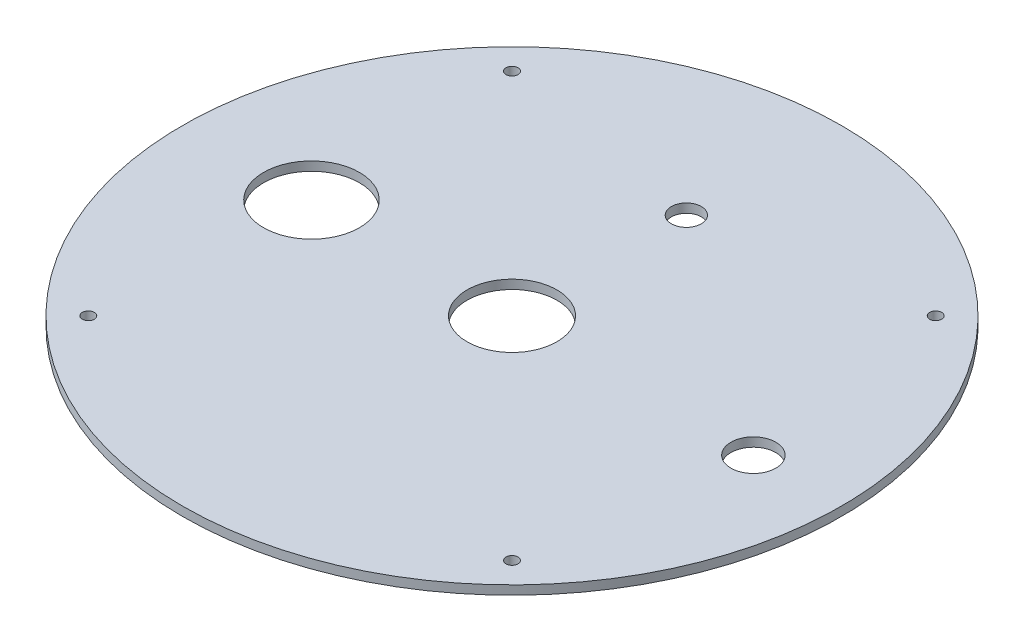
from build123d import *

# Parameters (mm, degrees)
SKETCH1_R           = 55
BOSS_EXTRUDE1_DEPTH = 1.5
SKETCH2_R           = 1
SKETCH2_R_2         = 7.5
CUT_EXTRUDE1_DEPTH  = 1.5
SKETCH5_R           = 8
SKETCH5_R_2         = 2.5
SKETCH5_R_3         = 3.75
CUT_EXTRUDE4_DEPTH  = 1.5


with BuildPart() as part:
    # Sketch1 → Boss-Extrude1 (new body)
    with BuildSketch(Plane(origin=(0, 0, 0), x_dir=(1, 0, 0), z_dir=(0, 1, 0))):
        with Locations(Location((0, 0, 0), (0, 0, 270))):
            Circle(SKETCH1_R)
    extrude(amount=BOSS_EXTRUDE1_DEPTH)

    # Sketch2 → Cut-Extrude1 (cut)
    with BuildSketch(Plane(origin=(0, 1.5, 0), x_dir=(1, 0, 0), z_dir=(0, 1, 0))):
        with Locations(Location((-35.355339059, 35.355339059, 0), (0, 0, 270))):
            Circle(SKETCH2_R)
        with Locations(Location((-35.355339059, -35.355339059, 0), (0, 0, 270))):
            Circle(SKETCH2_R)
        with Locations(Location((35.355339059, -35.355339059, 0), (0, 0, 270))):
            Circle(SKETCH2_R)
        with Locations(Location((35.355339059, 35.355339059, 0), (0, 0, 270))):
            Circle(SKETCH2_R)
        with Locations(Location((0, 0, 0), (0, 0, 270))):
            Circle(SKETCH2_R_2)
    extrude(amount=-CUT_EXTRUDE1_DEPTH, mode=Mode.SUBTRACT)

    # Sketch5 → Cut-Extrude4 (cut)
    with BuildSketch(Plane.XZ):
        with Locations(Location((-33.462326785, 0, 0), (0, 0, 270))):
            Circle(SKETCH5_R)
        with Locations(Location((0, -29.095513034, 0), (0, 0, 270))):
            Circle(SKETCH5_R_2)
        with Locations(Location((40.28609497, 0, 0), (0, 0, 270))):
            Circle(SKETCH5_R_3)
    extrude(amount=-CUT_EXTRUDE4_DEPTH, mode=Mode.SUBTRACT)


solid = part.part
